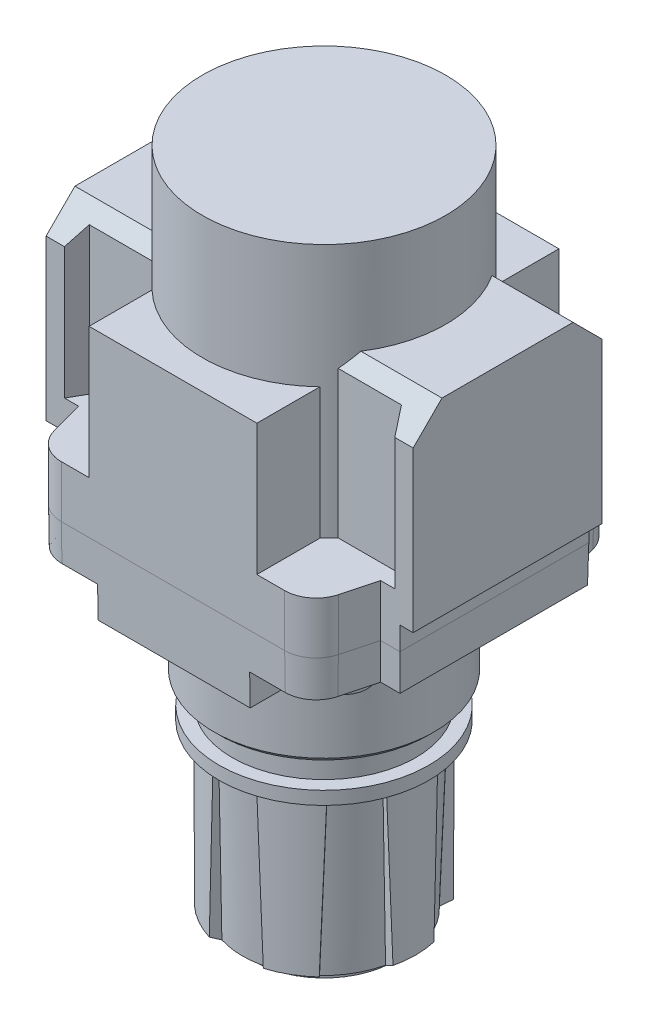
from build123d import *

# Parameters (mm, degrees)
PORT_HSG_DEPTH              = 35
CLAMP_GROOVE_DEPTH          = 57.401773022
MGT_BOSS_DEPTH              = 9.9
MGT_BOSS_ROUND_R            = 6
FILL_IN_SKETCH_W            = 63
FILL_IN_SKETCH_H            = 36
FILL_IN_DEPTH               = 9.9
DIAPHRAGM_START             = -36
DIAPHRAGM_HSG_SKETCH_R      = 23.2
DIAPHRAGM_HSG_DEPTH         = 48.5
INTERFACE_GROOVE_DEPTH      = 58.88298541
INTERFACE_GROOVE_DEPTH_BACK = 58.88298541
INTERFACE_GROOVE_SKETCH_W   = 2.5
INTERFACE_GROOVE_SKETCH_H   = 4.5
GAUGE_HSG_SKETCH_W          = 32
GAUGE_HSG_SKETCH_H          = 32
GAUGE_HSG_DEPTH             = 28.8
BONNET_DEPTH                = 13
BONNET_TAPER                = 1
BONNET_SCREW_CUTS_DEPTH     = 6
BONNET_SCREWS_SKETCH_R      = 4.5
BONNET_SCREWS_DEPTH         = 3
BONNET_CUT_DEPTH            = 58.88298546
BONNET_CUT_DEPTH_BACK       = 58.88298546
BONNET_CUT_SKETCH_W         = 8.7
BONNET_CUT_SKETCH_H         = 6
THREADS_SKETCH_R            = 21
THREADS_DEPTH               = 16
THREADS_CHAM_SIZE           = 1
THREADS_LOC_DEPTH           = 2
HANDLE_RIB_DEPTH            = 33.1
HANDLE_RIB_DRAFT            = -2
HANDLE_RIB_PAT_COPY_1_DEPTH = 33.1
HANDLE_RIB_PAT_COPY_1_DRAFT = -2
HANDLE_RIB_PAT_COPY_2_DEPTH = 33.1
HANDLE_RIB_PAT_COPY_2_DRAFT = -2
HANDLE_RIB_PAT_COPY_3_DEPTH = 33.1
HANDLE_RIB_PAT_COPY_3_DRAFT = -2
HANDLE_RIB_PAT_COPY_4_DEPTH = 33.1
HANDLE_RIB_PAT_COPY_4_DRAFT = -2
HANDLE_RIB_PAT_COPY_5_DEPTH = 33.1
HANDLE_RIB_PAT_COPY_5_DRAFT = -2
FLOW_ARROW_DEPTH            = 0.5


with BuildPart() as part:
    # Port Hsg_Sketch → Port Hsg (new, symmetric)
    with BuildSketch(Plane(origin=(0, 0, 0), x_dir=(0, 0, -1), z_dir=(1, 0, 0))):
        Polygon((12.5, 18), (-12.5, 18), (-18, 12.5), (-18, -22.4), (18, -22.4), (18, 12.5), align=None)
    extrude(amount=PORT_HSG_DEPTH, both=True)

    # Clamp Groove_Sketch → Clamp Groove (cut, through all)
    with BuildSketch(Plane.XZ.offset(22.4)):
        Polygon((-31.5, -18), (-29.767949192, -15), (29.767949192, -15), (31.5, -18), align=None)
        Polygon((31.5, 18), (29.767949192, 15), (-29.767949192, 15), (-31.5, 18), align=None)
    extrude(amount=-CLAMP_GROOVE_DEPTH, mode=Mode.SUBTRACT)

    # MGT Boss_Sketch → MGT Boss (add)
    with BuildSketch(Plane.XZ.offset(22.4)):
        Polygon((25.9, -28.8), (-25.9, -28.8), (-29.597698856, -15), (29.597698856, -15), align=None)
        Polygon((25.9, 28.8), (29.597698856, 15), (-29.597698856, 15), (-25.9, 28.8), align=None)
    extrude(amount=-MGT_BOSS_DEPTH)

    # MGT Boss Round
    mgt_boss_round_edges = [part.edges().sort_by_distance(p)[0] for p in [
        (-25.9, -17.45, 28.8),
        (25.9, -17.45, 28.8),
        (-25.9, -17.45, -28.8),
        (25.9, -17.45, -28.8),
    ]]
    fillet(mgt_boss_round_edges, radius=MGT_BOSS_ROUND_R)

    # Fill In_Sketch → Fill In (add)
    with BuildSketch(Plane.XZ.offset(22.4)):
        Rectangle(FILL_IN_SKETCH_W, FILL_IN_SKETCH_H)
    extrude(amount=-FILL_IN_DEPTH)

    # Diaphragm Hsg_Sketch → Diaphragm Hsg (add)
    with BuildSketch(Plane.XZ.offset(DIAPHRAGM_START)):
        with Locations(Location((0, 0, 0), (0, 0, 270))):
            Circle(DIAPHRAGM_HSG_SKETCH_R)
    extrude(amount=DIAPHRAGM_HSG_DEPTH)

    # Interface Groove_Sketch → Interface Groove (cut, two sides: drawn at the far end of the back side and taken through both)
    with BuildSketch(Plane.XY.offset(-INTERFACE_GROOVE_DEPTH_BACK)):
        with Locations((-33.75, -20.25)):
            Rectangle(INTERFACE_GROOVE_SKETCH_W, INTERFACE_GROOVE_SKETCH_H)
        with Locations((33.75, -20.25)):
            Rectangle(INTERFACE_GROOVE_SKETCH_W, INTERFACE_GROOVE_SKETCH_H)
    extrude(amount=INTERFACE_GROOVE_DEPTH + INTERFACE_GROOVE_DEPTH_BACK, mode=Mode.SUBTRACT)

    # Gauge Hsg_Sketch → Gauge Hsg (add, symmetric)
    with BuildSketch(Plane.XY):
        with Locations((0, -3.5)):
            Rectangle(GAUGE_HSG_SKETCH_W, GAUGE_HSG_SKETCH_H)
    extrude(amount=GAUGE_HSG_DEPTH, both=True)

    # Bonnet_Sketch → Bonnet (add)
    with BuildSketch(Plane.XZ.offset(22.4)):
        with BuildLine():
            Line((-27.09159303, 24.352914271), (-28.793851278, 18))
            Line((-28.793851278, 18), (-32.5, 18))
            Line((-32.5, 18), (-32.5, -18))
            Line((-32.5, -18), (-28.793851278, -18))
            Line((-28.793851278, -18), (-27.09159303, -24.352914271))
            ThreePointArc((-27.09159303, -24.352914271), (-24.948606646, -27.560120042), (-21.296038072, -28.8))
            Line((-21.296038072, -28.8), (21.296038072, -28.8))
            ThreePointArc((21.296038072, -28.8), (24.948606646, -27.560120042), (27.09159303, -24.352914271))
            Line((27.09159303, -24.352914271), (28.793851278, -18))
            Line((28.793851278, -18), (32.5, -18))
            Line((32.5, -18), (32.5, 18))
            Line((32.5, 18), (28.793851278, 18))
            Line((28.793851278, 18), (27.09159303, 24.352914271))
            ThreePointArc((27.09159303, 24.352914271), (24.948606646, 27.560120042), (21.296038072, 28.8))
            Line((21.296038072, 28.8), (-21.296038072, 28.8))
            ThreePointArc((-21.296038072, 28.8), (-24.948606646, 27.560120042), (-27.09159303, 24.352914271))
        make_face()
    extrude(amount=BONNET_DEPTH, taper=BONNET_TAPER)

    # Bonnet Screw Cuts_Sketch → Bonnet Screw Cuts (cut)
    with BuildSketch(Plane.XZ.offset(35.4)):
        with BuildLine():
            Line((14.5, 28.8), (32.5, 28.8))
            Line((32.5, 28.8), (32.5, 10.8))
            Line((32.5, 10.8), (21, 10.8))
            ThreePointArc((21, 10.8), (16.403805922, 12.703805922), (14.5, 17.3))
            Line((14.5, 17.3), (14.5, 28.8))
        make_face()
        with BuildLine():
            Line((-32.5, 28.8), (-32.5, 10.8))
            Line((-32.5, 10.8), (-21, 10.8))
            ThreePointArc((-21, 10.8), (-16.403805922, 12.703805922), (-14.5, 17.3))
            Line((-14.5, 17.3), (-14.5, 28.8))
            Line((-14.5, 28.8), (-32.5, 28.8))
        make_face()
        with BuildLine():
            Line((-14.5, -28.8), (-32.5, -28.8))
            Line((-32.5, -28.8), (-32.5, -10.8))
            Line((-32.5, -10.8), (-21, -10.8))
            ThreePointArc((-21, -10.8), (-16.403805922, -12.703805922), (-14.5, -17.3))
            Line((-14.5, -17.3), (-14.5, -28.8))
        make_face()
        with BuildLine():
            Line((32.5, -28.8), (32.5, -10.8))
            Line((32.5, -10.8), (21, -10.8))
            ThreePointArc((21, -10.8), (16.403805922, -12.703805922), (14.5, -17.3))
            Line((14.5, -17.3), (14.5, -28.8))
            Line((14.5, -28.8), (32.5, -28.8))
        make_face()
    extrude(amount=-BONNET_SCREW_CUTS_DEPTH, mode=Mode.SUBTRACT)

    # Bonnet Screws_Sketch → Bonnet Screws (add)
    with BuildSketch(Plane.XZ.offset(29.4)):
        with Locations(Location((21, 17.3, 0), (0, 0, 90))):
            Circle(BONNET_SCREWS_SKETCH_R)
        with Locations(Location((-21, 17.3, 0), (0, 0, 90))):
            Circle(BONNET_SCREWS_SKETCH_R)
        with Locations(Location((-21, -17.3, 0), (0, 0, 90))):
            Circle(BONNET_SCREWS_SKETCH_R)
        with Locations(Location((21, -17.3, 0), (0, 0, 90))):
            Circle(BONNET_SCREWS_SKETCH_R)
    extrude(amount=BONNET_SCREWS_DEPTH)

    # Bonnet Cut_Sketch → Bonnet Cut (cut, two sides: drawn at the far end of the back side and taken through both)
    with BuildSketch(Plane.XY.offset(-BONNET_CUT_DEPTH_BACK)):
        with Locations((30.65, -32.4)):
            Rectangle(BONNET_CUT_SKETCH_W, BONNET_CUT_SKETCH_H)
        with Locations((-30.65, -32.4)):
            Rectangle(BONNET_CUT_SKETCH_W, BONNET_CUT_SKETCH_H)
    extrude(amount=BONNET_CUT_DEPTH + BONNET_CUT_DEPTH_BACK, mode=Mode.SUBTRACT)

    # Threads_Sketch → Threads (add)
    with BuildSketch(Plane.XZ.offset(35.4)):
        with Locations(Location((0, 0, 0), (0, 0, 44.098525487))):
            Circle(THREADS_SKETCH_R)
    extrude(amount=THREADS_DEPTH)

    # Threads Cham
    threads_cham_edges = [part.edges().sort_by_distance(p)[0] for p in [
        (-15.081028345, -51.4, -14.613780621),
    ]]
    chamfer(threads_cham_edges, length=THREADS_CHAM_SIZE)

    # Threads Loc_Sketch → Threads Loc (add)
    with BuildSketch(Plane.XZ.offset(35.4)):
        with BuildLine():
            Line((0, 3.5), (0, -3.5))
            Line((0, -3.5), (-21, -3.5))
            ThreePointArc((-21, -3.5), (-24.5, 0), (-21, 3.5))
            Line((-21, 3.5), (0, 3.5))
        make_face()
    extrude(amount=THREADS_LOC_DEPTH)

    # Handle_Sketch → Handle (revolve)
    with BuildSketch(Plane.XY, mode=Mode.PRIVATE) as handle_sk:
        Polygon((-17.5, -51.4), (-17.5, -56.4), (-20, -56.4), (-20, -58.9), (-17.5, -58.9), (-17.5, -92), (0, -92), (0, -51.4), align=None)
    revolve(handle_sk.sketch.rotate(Axis((0, -31.089518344, 0), (0, -1, 0)), 270), axis=Axis((0, -31.089518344, 0), (0, -1, 0)))


with BuildPart() as handle_rib_tool:
    # Handle Rib_Sketch → Handle Rib (with draft: the straight prism first)
    with BuildSketch(Plane.XZ.offset(92)):
        with BuildLine():
            ThreePointArc((-4.65, 14.786057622), (0, 15.5), (4.65, 14.786057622))
            Line((4.65, 14.786057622), (6, 19.078784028))
            ThreePointArc((6, 19.078784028), (0, 20), (-6, 19.078784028))
            Line((-6, 19.078784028), (-4.65, 14.786057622))
        make_face()
    extrude(amount=-HANDLE_RIB_DEPTH)
    # Handle Rib: the draft: its side faces are tilted about the plane it starts from
    handle_rib_sides = [handle_rib_tool.faces().sort_by_distance(p)[0] for p in [
        (-5.325, -75.45, 16.932420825),
        (0, -75.45, 15.5),
        (5.325, -75.45, 16.932420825),
        (0, -75.45, 20),
    ]]
    draft(handle_rib_sides, Plane.XZ.offset(92), HANDLE_RIB_DRAFT)


with BuildPart() as part_1:
    add(part.part)

    # Handle Rib: cut by handle_rib_tool
    add(handle_rib_tool.part, mode=Mode.SUBTRACT)


with BuildPart() as handle_rib_pat_copy_1_tool:
    # Handle Rib Pat copy 1 sketch → Handle Rib Pat copy 1 (with draft: the straight prism first)
    with BuildSketch(Plane(origin=(0, -92, 0), x_dir=(0.5000000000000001, 0, -0.8660254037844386), z_dir=(0, -1, 0))):
        with BuildLine():
            ThreePointArc((-4.65, 14.786057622), (0, 15.5), (4.65, 14.786057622))
            Line((4.65, 14.786057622), (6, 19.078784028))
            ThreePointArc((6, 19.078784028), (0, 20), (-6, 19.078784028))
            Line((-6, 19.078784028), (-4.65, 14.786057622))
        make_face()
    extrude(amount=-HANDLE_RIB_PAT_COPY_1_DEPTH)
    # Handle Rib Pat copy 1: the draft: its side faces are tilted about the plane it starts from
    handle_rib_pat_copy_1_sides = [handle_rib_pat_copy_1_tool.faces().sort_by_distance(p)[0] for p in [
        (12.001406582, -75.45, 13.077795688),
        (13.423393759, -75.45, 7.75),
        (17.326406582, -75.45, 3.854625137),
        (17.320508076, -75.45, 10),
    ]]
    draft(handle_rib_pat_copy_1_sides, Plane(origin=(0, -92, 0), x_dir=(0.5000000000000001, 0, -0.8660254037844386), z_dir=(0, -1, 0)), HANDLE_RIB_PAT_COPY_1_DRAFT)


with BuildPart() as part_2:
    add(part_1.part)

    # Handle Rib Pat copy 1: cut by handle_rib_pat_copy_1_tool
    add(handle_rib_pat_copy_1_tool.part, mode=Mode.SUBTRACT)


with BuildPart() as handle_rib_pat_copy_2_tool:
    # Handle Rib Pat copy 2 sketch → Handle Rib Pat copy 2 (with draft: the straight prism first)
    with BuildSketch(Plane(origin=(0, -92, 0), x_dir=(-0.4999999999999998, 0, -0.8660254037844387), z_dir=(0, -1, 0))):
        with BuildLine():
            ThreePointArc((-4.65, 14.786057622), (0, 15.5), (4.65, 14.786057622))
            Line((4.65, 14.786057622), (6, 19.078784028))
            ThreePointArc((6, 19.078784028), (0, 20), (-6, 19.078784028))
            Line((-6, 19.078784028), (-4.65, 14.786057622))
        make_face()
    extrude(amount=-HANDLE_RIB_PAT_COPY_2_DEPTH)
    # Handle Rib Pat copy 2: the draft: its side faces are tilted about the plane it starts from
    handle_rib_pat_copy_2_sides = [handle_rib_pat_copy_2_tool.faces().sort_by_distance(p)[0] for p in [
        (17.326406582, -75.45, -3.854625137),
        (13.423393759, -75.45, -7.75),
        (12.001406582, -75.45, -13.077795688),
        (17.320508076, -75.45, -10),
    ]]
    draft(handle_rib_pat_copy_2_sides, Plane(origin=(0, -92, 0), x_dir=(-0.4999999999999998, 0, -0.8660254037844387), z_dir=(0, -1, 0)), HANDLE_RIB_PAT_COPY_2_DRAFT)


with BuildPart() as part_3:
    add(part_2.part)

    # Handle Rib Pat copy 2: cut by handle_rib_pat_copy_2_tool
    add(handle_rib_pat_copy_2_tool.part, mode=Mode.SUBTRACT)


with BuildPart() as handle_rib_pat_copy_3_tool:
    # Handle Rib Pat copy 3 sketch → Handle Rib Pat copy 3 (with draft: the straight prism first)
    with BuildSketch(Plane(origin=(0, -92, 0), x_dir=(-1, 0, 0), z_dir=(0, -1, 0))):
        with BuildLine():
            ThreePointArc((-4.65, 14.786057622), (0, 15.5), (4.65, 14.786057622))
            Line((4.65, 14.786057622), (6, 19.078784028))
            ThreePointArc((6, 19.078784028), (0, 20), (-6, 19.078784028))
            Line((-6, 19.078784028), (-4.65, 14.786057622))
        make_face()
    extrude(amount=-HANDLE_RIB_PAT_COPY_3_DEPTH)
    # Handle Rib Pat copy 3: the draft: its side faces are tilted about the plane it starts from
    handle_rib_pat_copy_3_sides = [handle_rib_pat_copy_3_tool.faces().sort_by_distance(p)[0] for p in [
        (5.325, -75.45, -16.932420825),
        (0, -75.45, -15.5),
        (-5.325, -75.45, -16.932420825),
        (0, -75.45, -20),
    ]]
    draft(handle_rib_pat_copy_3_sides, Plane(origin=(0, -92, 0), x_dir=(-1, 0, 0), z_dir=(0, -1, 0)), HANDLE_RIB_PAT_COPY_3_DRAFT)


with BuildPart() as part_4:
    add(part_3.part)

    # Handle Rib Pat copy 3: cut by handle_rib_pat_copy_3_tool
    add(handle_rib_pat_copy_3_tool.part, mode=Mode.SUBTRACT)


with BuildPart() as handle_rib_pat_copy_4_tool:
    # Handle Rib Pat copy 4 sketch → Handle Rib Pat copy 4 (with draft: the straight prism first)
    with BuildSketch(Plane(origin=(0, -92, 0), x_dir=(-0.5000000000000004, 0, 0.8660254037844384), z_dir=(0, -1, 0))):
        with BuildLine():
            ThreePointArc((-4.65, 14.786057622), (0, 15.5), (4.65, 14.786057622))
            Line((4.65, 14.786057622), (6, 19.078784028))
            ThreePointArc((6, 19.078784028), (0, 20), (-6, 19.078784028))
            Line((-6, 19.078784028), (-4.65, 14.786057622))
        make_face()
    extrude(amount=-HANDLE_RIB_PAT_COPY_4_DEPTH)
    # Handle Rib Pat copy 4: the draft: its side faces are tilted about the plane it starts from
    handle_rib_pat_copy_4_sides = [handle_rib_pat_copy_4_tool.faces().sort_by_distance(p)[0] for p in [
        (-12.001406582, -75.45, -13.077795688),
        (-13.423393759, -75.45, -7.75),
        (-17.326406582, -75.45, -3.854625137),
        (-17.320508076, -75.45, -10),
    ]]
    draft(handle_rib_pat_copy_4_sides, Plane(origin=(0, -92, 0), x_dir=(-0.5000000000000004, 0, 0.8660254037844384), z_dir=(0, -1, 0)), HANDLE_RIB_PAT_COPY_4_DRAFT)


with BuildPart() as part_5:
    add(part_4.part)

    # Handle Rib Pat copy 4: cut by handle_rib_pat_copy_4_tool
    add(handle_rib_pat_copy_4_tool.part, mode=Mode.SUBTRACT)


with BuildPart() as handle_rib_pat_copy_5_tool:
    # Handle Rib Pat copy 5 sketch → Handle Rib Pat copy 5 (with draft: the straight prism first)
    with BuildSketch(Plane(origin=(0, -92, 0), x_dir=(0.5000000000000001, 0, 0.8660254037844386), z_dir=(0, -1, 0))):
        with BuildLine():
            ThreePointArc((-4.65, 14.786057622), (0, 15.5), (4.65, 14.786057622))
            Line((4.65, 14.786057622), (6, 19.078784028))
            ThreePointArc((6, 19.078784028), (0, 20), (-6, 19.078784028))
            Line((-6, 19.078784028), (-4.65, 14.786057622))
        make_face()
    extrude(amount=-HANDLE_RIB_PAT_COPY_5_DEPTH)
    # Handle Rib Pat copy 5: the draft: its side faces are tilted about the plane it starts from
    handle_rib_pat_copy_5_sides = [handle_rib_pat_copy_5_tool.faces().sort_by_distance(p)[0] for p in [
        (-17.326406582, -75.45, 3.854625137),
        (-13.423393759, -75.45, 7.75),
        (-12.001406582, -75.45, 13.077795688),
        (-17.320508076, -75.45, 10),
    ]]
    draft(handle_rib_pat_copy_5_sides, Plane(origin=(0, -92, 0), x_dir=(0.5000000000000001, 0, 0.8660254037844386), z_dir=(0, -1, 0)), HANDLE_RIB_PAT_COPY_5_DRAFT)


with BuildPart() as part_6:
    add(part_5.part)

    # Handle Rib Pat copy 5: cut by handle_rib_pat_copy_5_tool
    add(handle_rib_pat_copy_5_tool.part, mode=Mode.SUBTRACT)

    # Handle Cham_Sketch → Handle Cham (revolve, cut)
    with BuildSketch(Plane.XY, mode=Mode.PRIVATE) as handle_cham_sk:
        Polygon((-17.5, -92), (-17.5, -89), (-13.5, -91.309401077), (-13.5, -92), align=None)
    revolve(handle_cham_sk.sketch.rotate(Axis((0, 0, 0), (0, -1, 0)), 270), axis=Axis((0, 0, 0), (0, -1, 0)), mode=Mode.SUBTRACT)

    # Flow Arrow_Sketch → Flow Arrow (cut)
    with BuildSketch(Plane(origin=(-4.256251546, 18, 3.360455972), x_dir=(-1, 0, 0), z_dir=(0, 1, 0))):
        Polygon((25.743748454, -6.247207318), (25.743748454, -0.473704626), (20.743748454, -3.360455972), align=None)
    extrude(amount=-FLOW_ARROW_DEPTH, mode=Mode.SUBTRACT)


solid = part_6.part
